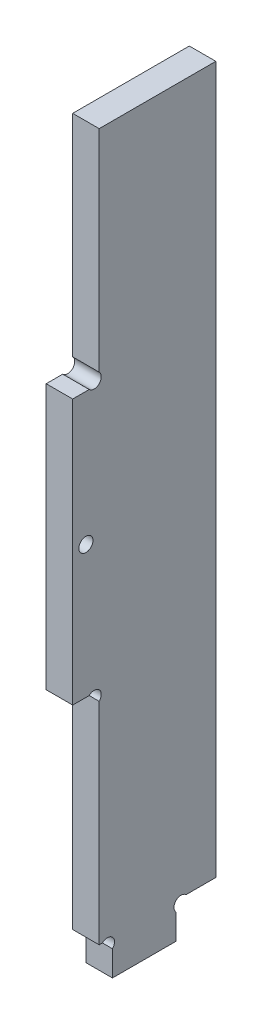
from build123d import *

# Parameters (mm, degrees)
ESQUISSE1_R        = 1.6
BOSS_EXTRU_1_DEPTH = 6


with BuildPart() as part:
    # Esquisse1 → Boss.-Extru.1 (new body)
    with BuildSketch(Plane(origin=(0, 0, 0), x_dir=(0, 0, -1), z_dir=(1, 0, 0))):
        with BuildLine():
            Line((6.7372583, 8), (6, 8))
            Line((6, 8), (6, 55.7372583))
            ThreePointArc((6, 55.7372583), (6, 58), (3.7372583, 58))
            Line((3.7372583, 58), (0, 58))
            Line((0, 58), (0, 118))
            Line((0, 118), (3.7372583, 118))
            ThreePointArc((3.7372583, 118), (6, 118), (6, 120.2627417))
            Line((6, 120.2627417), (6, 168))
            Line((6, 168), (32.4, 168))
            Line((32.4, 168), (32.4, 8))
            Line((32.4, 8), (25.6627417, 8))
            ThreePointArc((25.6627417, 8), (23.4, 8), (23.4, 5.7372583))
            Line((23.4, 5.7372583), (23.4, 0))
            Line((23.4, 0), (9, 0))
            Line((9, 0), (9, 5.7372583))
            ThreePointArc((9, 5.7372583), (9, 8), (6.7372583, 8))
        make_face()
        with Locations((3, 88)):
            Circle(ESQUISSE1_R, mode=Mode.SUBTRACT)
    extrude(amount=BOSS_EXTRU_1_DEPTH)


solid = part.part
